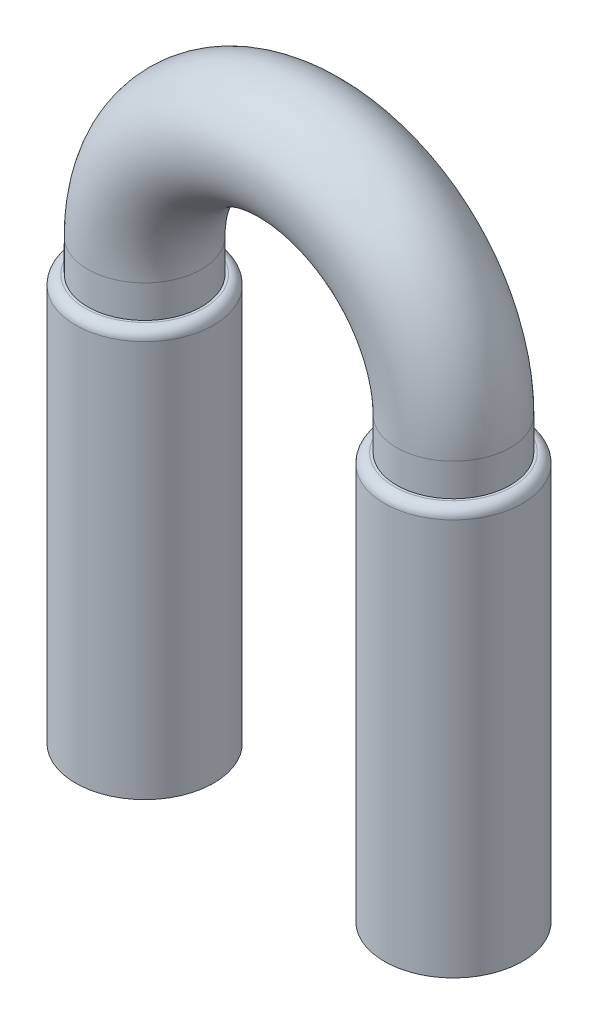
ISO-10303-21;
HEADER;
FILE_DESCRIPTION(('STEP AP214'),'2;1');
FILE_NAME('part.step','',(''),(''),'','','');
FILE_SCHEMA(('AUTOMOTIVE_DESIGN { 1 0 10303 214 1 1 1 1 }'));
ENDSEC;
DATA;
#1=APPLICATION_CONTEXT('core data for automotive mechanical design processes');
#2=APPLICATION_PROTOCOL_DEFINITION('international standard','automotive_design',2000,#1);
#3=PRODUCT_CONTEXT('',#1,'mechanical');
#4=PRODUCT('Part','Part','',(#3));
#5=PRODUCT_RELATED_PRODUCT_CATEGORY('part','',(#4));
#6=PRODUCT_DEFINITION_FORMATION('','',#4);
#7=PRODUCT_DEFINITION_CONTEXT('part definition',#1,'design');
#8=PRODUCT_DEFINITION('design','',#6,#7);
#9=PRODUCT_DEFINITION_SHAPE('','',#8);
#10=(LENGTH_UNIT() NAMED_UNIT(*) SI_UNIT(.MILLI.,.METRE.));
#11=(NAMED_UNIT(*) PLANE_ANGLE_UNIT() SI_UNIT($,.RADIAN.));
#12=(NAMED_UNIT(*) SI_UNIT($,.STERADIAN.) SOLID_ANGLE_UNIT());
#13=UNCERTAINTY_MEASURE_WITH_UNIT(LENGTH_MEASURE(1.E-05),#10,'distance_accuracy_value','');
#14=(GEOMETRIC_REPRESENTATION_CONTEXT(3) GLOBAL_UNCERTAINTY_ASSIGNED_CONTEXT((#13)) GLOBAL_UNIT_ASSIGNED_CONTEXT((#10,
#11,#12)) REPRESENTATION_CONTEXT('',''));
#15=CARTESIAN_POINT('',(0.,0.,0.));
#16=DIRECTION('',(0.,0.,1.));
#17=DIRECTION('',(1.,0.,0.));
#18=AXIS2_PLACEMENT_3D('',#15,#16,#17);
#19=CARTESIAN_POINT('',(0.,0.,0.));
#20=DIRECTION('',(0.,1.,0.));
#21=DIRECTION('',(0.,0.,1.));
#22=AXIS2_PLACEMENT_3D('',#19,#20,#21);
#23=CYLINDRICAL_SURFACE('',#22,3.5);
#24=CARTESIAN_POINT('',(0.,27.,0.));
#25=DIRECTION('',(0.,1.,0.));
#26=DIRECTION('',(0.,0.,1.));
#27=AXIS2_PLACEMENT_3D('',#24,#25,#26);
#28=CIRCLE('',#27,3.5);
#29=CARTESIAN_POINT('',(-3.5,27.,0.));
#30=VERTEX_POINT('',#29);
#31=EDGE_CURVE('E60',#30,#30,#28,.T.);
#32=ORIENTED_EDGE('',*,*,#31,.F.);
#33=EDGE_LOOP('',(#32));
#34=FACE_BOUND('',#33,.T.);
#35=CARTESIAN_POINT('',(0.,25.,0.));
#36=DIRECTION('',(0.,-1.,0.));
#37=DIRECTION('',(0.,0.,-1.));
#38=AXIS2_PLACEMENT_3D('',#35,#36,#37);
#39=CIRCLE('',#38,3.5);
#40=CARTESIAN_POINT('',(0.,25.,-3.5));
#41=VERTEX_POINT('',#40);
#42=EDGE_CURVE('E52',#41,#41,#39,.F.);
#43=ORIENTED_EDGE('',*,*,#42,.T.);
#44=EDGE_LOOP('',(#43));
#45=FACE_BOUND('',#44,.T.);
#46=ADVANCED_FACE('F31',(#34,#45),#23,.T.);
#47=CARTESIAN_POINT('',(19.,27.,0.));
#48=DIRECTION('',(0.,-1.,0.));
#49=DIRECTION('',(0.,0.,-1.));
#50=AXIS2_PLACEMENT_3D('',#47,#48,#49);
#51=CYLINDRICAL_SURFACE('',#50,3.5);
#52=CARTESIAN_POINT('',(19.,27.,0.));
#53=DIRECTION('',(0.,-1.,0.));
#54=DIRECTION('',(0.,0.,1.));
#55=AXIS2_PLACEMENT_3D('',#52,#53,#54);
#56=CIRCLE('',#55,3.5);
#57=CARTESIAN_POINT('',(22.5,27.,0.));
#58=VERTEX_POINT('',#57);
#59=EDGE_CURVE('E51',#58,#58,#56,.T.);
#60=ORIENTED_EDGE('',*,*,#59,.T.);
#61=EDGE_LOOP('',(#60));
#62=FACE_BOUND('',#61,.T.);
#63=CARTESIAN_POINT('',(19.,25.,0.));
#64=DIRECTION('',(0.,-1.,0.));
#65=DIRECTION('',(0.,0.,-1.));
#66=AXIS2_PLACEMENT_3D('',#63,#64,#65);
#67=CIRCLE('',#66,3.5);
#68=CARTESIAN_POINT('',(19.,25.,-3.5));
#69=VERTEX_POINT('',#68);
#70=EDGE_CURVE('E57',#69,#69,#67,.F.);
#71=ORIENTED_EDGE('',*,*,#70,.T.);
#72=EDGE_LOOP('',(#71));
#73=FACE_BOUND('',#72,.T.);
#74=ADVANCED_FACE('F89',(#62,#73),#51,.T.);
#75=CARTESIAN_POINT('',(9.5,27.,0.));
#76=DIRECTION('',(0.,0.,-1.));
#77=DIRECTION('',(-1.,0.,0.));
#78=AXIS2_PLACEMENT_3D('',#75,#76,#77);
#79=TOROIDAL_SURFACE('',#78,9.5,3.5);
#80=CARTESIAN_POINT('',(9.5,27.,0.));
#81=DIRECTION('',(0.,0.,-1.));
#82=DIRECTION('',(-1.,0.,0.));
#83=AXIS2_PLACEMENT_3D('',#80,#81,#82);
#84=CIRCLE('',#83,13.);
#85=EDGE_CURVE('',#30,#58,#84,.T.);
#86=ORIENTED_EDGE('',*,*,#31,.T.);
#87=ORIENTED_EDGE('',*,*,#59,.F.);
#88=ORIENTED_EDGE('',*,*,#85,.T.);
#89=ORIENTED_EDGE('',*,*,#85,.F.);
#90=EDGE_LOOP('',(#86,#88,#87,#89));
#91=FACE_BOUND('',#90,.T.);
#92=ADVANCED_FACE('F95',(#91),#79,.T.);
#93=CARTESIAN_POINT('',(19.,25.,0.));
#94=DIRECTION('',(0.,-1.,0.));
#95=DIRECTION('',(0.,0.,-1.));
#96=AXIS2_PLACEMENT_3D('',#93,#94,#95);
#97=CYLINDRICAL_SURFACE('',#96,4.25);
#98=CARTESIAN_POINT('',(19.,24.4,0.));
#99=DIRECTION('',(0.,-1.,0.));
#100=DIRECTION('',(0.,0.,-1.));
#101=AXIS2_PLACEMENT_3D('',#98,#99,#100);
#102=CIRCLE('',#101,4.25);
#103=CARTESIAN_POINT('',(19.,24.4,-4.25));
#104=VERTEX_POINT('',#103);
#105=EDGE_CURVE('E38',#104,#104,#102,.T.);
#106=ORIENTED_EDGE('',*,*,#105,.T.);
#107=EDGE_LOOP('',(#106));
#108=FACE_BOUND('',#107,.T.);
#109=CARTESIAN_POINT('',(19.,0.,0.));
#110=DIRECTION('',(0.,-1.,0.));
#111=DIRECTION('',(0.,0.,-1.));
#112=AXIS2_PLACEMENT_3D('',#109,#110,#111);
#113=CIRCLE('',#112,4.25);
#114=CARTESIAN_POINT('',(19.,0.,-4.25));
#115=VERTEX_POINT('',#114);
#116=EDGE_CURVE('E55',#115,#115,#113,.T.);
#117=ORIENTED_EDGE('',*,*,#116,.F.);
#118=EDGE_LOOP('',(#117));
#119=FACE_BOUND('',#118,.T.);
#120=ADVANCED_FACE('F102',(#108,#119),#97,.T.);
#121=CARTESIAN_POINT('',(19.,25.,0.));
#122=DIRECTION('',(0.,-1.,0.));
#123=DIRECTION('',(0.,0.,-1.));
#124=AXIS2_PLACEMENT_3D('',#121,#122,#123);
#125=PLANE('',#124);
#126=CARTESIAN_POINT('',(19.,25.,0.));
#127=DIRECTION('',(0.,-1.,0.));
#128=DIRECTION('',(0.,0.,-1.));
#129=AXIS2_PLACEMENT_3D('',#126,#127,#128);
#130=CIRCLE('',#129,3.65);
#131=CARTESIAN_POINT('',(19.,25.,-3.65));
#132=VERTEX_POINT('',#131);
#133=EDGE_CURVE('E10',#132,#132,#130,.F.);
#134=ORIENTED_EDGE('',*,*,#133,.T.);
#135=EDGE_LOOP('',(#134));
#136=FACE_BOUND('',#135,.T.);
#137=ORIENTED_EDGE('',*,*,#70,.F.);
#138=EDGE_LOOP('',(#137));
#139=FACE_BOUND('',#138,.T.);
#140=ADVANCED_FACE('F84',(#136,#139),#125,.F.);
#141=CARTESIAN_POINT('',(19.,0.,0.));
#142=DIRECTION('',(0.,-1.,0.));
#143=DIRECTION('',(0.,0.,1.));
#144=AXIS2_PLACEMENT_3D('',#141,#142,#143);
#145=PLANE('',#144);
#146=ORIENTED_EDGE('',*,*,#116,.T.);
#147=EDGE_LOOP('',(#146));
#148=FACE_BOUND('',#147,.T.);
#149=ADVANCED_FACE('F75',(#148),#145,.T.);
#150=CARTESIAN_POINT('',(0.,25.,0.));
#151=DIRECTION('',(0.,-1.,0.));
#152=DIRECTION('',(0.,0.,-1.));
#153=AXIS2_PLACEMENT_3D('',#150,#151,#152);
#154=CYLINDRICAL_SURFACE('',#153,4.25);
#155=CARTESIAN_POINT('',(0.,24.4,0.));
#156=DIRECTION('',(0.,-1.,0.));
#157=DIRECTION('',(0.,0.,-1.));
#158=AXIS2_PLACEMENT_3D('',#155,#156,#157);
#159=CIRCLE('',#158,4.25);
#160=CARTESIAN_POINT('',(0.,24.4,-4.25));
#161=VERTEX_POINT('',#160);
#162=EDGE_CURVE('E46',#161,#161,#159,.T.);
#163=ORIENTED_EDGE('',*,*,#162,.T.);
#164=EDGE_LOOP('',(#163));
#165=FACE_BOUND('',#164,.T.);
#166=CARTESIAN_POINT('',(0.,0.,0.));
#167=DIRECTION('',(0.,-1.,0.));
#168=DIRECTION('',(0.,0.,-1.));
#169=AXIS2_PLACEMENT_3D('',#166,#167,#168);
#170=CIRCLE('',#169,4.25);
#171=CARTESIAN_POINT('',(0.,0.,-4.25));
#172=VERTEX_POINT('',#171);
#173=EDGE_CURVE('E56',#172,#172,#170,.T.);
#174=ORIENTED_EDGE('',*,*,#173,.F.);
#175=EDGE_LOOP('',(#174));
#176=FACE_BOUND('',#175,.T.);
#177=ADVANCED_FACE('F72',(#165,#176),#154,.T.);
#178=CARTESIAN_POINT('',(0.,25.,0.));
#179=DIRECTION('',(0.,-1.,0.));
#180=DIRECTION('',(0.,0.,-1.));
#181=AXIS2_PLACEMENT_3D('',#178,#179,#180);
#182=PLANE('',#181);
#183=CARTESIAN_POINT('',(0.,25.,0.));
#184=DIRECTION('',(0.,-1.,0.));
#185=DIRECTION('',(0.,0.,-1.));
#186=AXIS2_PLACEMENT_3D('',#183,#184,#185);
#187=CIRCLE('',#186,3.65);
#188=CARTESIAN_POINT('',(0.,25.,-3.65));
#189=VERTEX_POINT('',#188);
#190=EDGE_CURVE('E42',#189,#189,#187,.F.);
#191=ORIENTED_EDGE('',*,*,#190,.T.);
#192=EDGE_LOOP('',(#191));
#193=FACE_BOUND('',#192,.T.);
#194=ORIENTED_EDGE('',*,*,#42,.F.);
#195=EDGE_LOOP('',(#194));
#196=FACE_BOUND('',#195,.T.);
#197=ADVANCED_FACE('F74',(#193,#196),#182,.F.);
#198=CARTESIAN_POINT('',(0.,0.,0.));
#199=DIRECTION('',(0.,1.,0.));
#200=DIRECTION('',(0.,0.,1.));
#201=AXIS2_PLACEMENT_3D('',#198,#199,#200);
#202=PLANE('',#201);
#203=ORIENTED_EDGE('',*,*,#173,.T.);
#204=EDGE_LOOP('',(#203));
#205=FACE_BOUND('',#204,.T.);
#206=ADVANCED_FACE('F70',(#205),#202,.F.);
#207=CARTESIAN_POINT('',(0.,24.4,0.));
#208=DIRECTION('',(0.,-1.,0.));
#209=DIRECTION('',(0.,0.,-1.));
#210=AXIS2_PLACEMENT_3D('',#207,#208,#209);
#211=TOROIDAL_SURFACE('',#210,3.65,0.6);
#212=ORIENTED_EDGE('',*,*,#190,.F.);
#213=EDGE_LOOP('',(#212));
#214=FACE_BOUND('',#213,.T.);
#215=ORIENTED_EDGE('',*,*,#162,.F.);
#216=EDGE_LOOP('',(#215));
#217=FACE_BOUND('',#216,.T.);
#218=ADVANCED_FACE('F107',(#214,#217),#211,.T.);
#219=CARTESIAN_POINT('',(19.,24.4,0.));
#220=DIRECTION('',(0.,-1.,0.));
#221=DIRECTION('',(0.,0.,-1.));
#222=AXIS2_PLACEMENT_3D('',#219,#220,#221);
#223=TOROIDAL_SURFACE('',#222,3.65,0.6);
#224=ORIENTED_EDGE('',*,*,#133,.F.);
#225=EDGE_LOOP('',(#224));
#226=FACE_BOUND('',#225,.T.);
#227=ORIENTED_EDGE('',*,*,#105,.F.);
#228=EDGE_LOOP('',(#227));
#229=FACE_BOUND('',#228,.T.);
#230=ADVANCED_FACE('F33',(#226,#229),#223,.T.);
#231=CLOSED_SHELL('',(#46,#74,#92,#120,#140,#149,#177,#197,#206,#218,#230));
#232=MANIFOLD_SOLID_BREP('B2',#231);
#233=ADVANCED_BREP_SHAPE_REPRESENTATION('',(#18,#232),#14);
#234=SHAPE_DEFINITION_REPRESENTATION(#9,#233);
ENDSEC;
END-ISO-10303-21;
